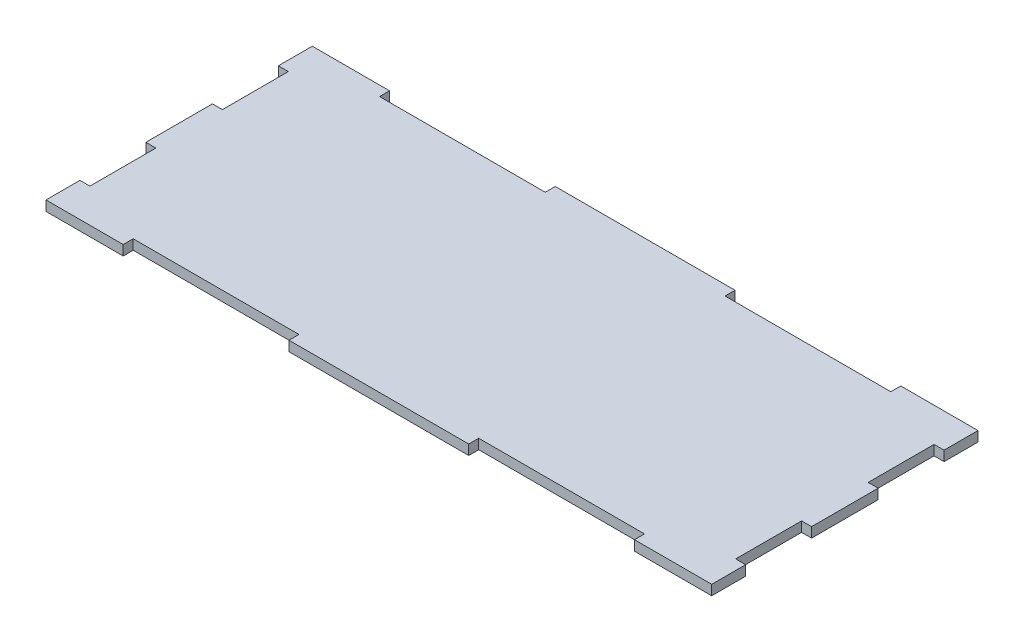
ISO-10303-21;
HEADER;
FILE_DESCRIPTION(('STEP AP214'),'2;1');
FILE_NAME('part.step','',(''),(''),'','','');
FILE_SCHEMA(('AUTOMOTIVE_DESIGN { 1 0 10303 214 1 1 1 1 }'));
ENDSEC;
DATA;
#1=APPLICATION_CONTEXT('core data for automotive mechanical design processes');
#2=APPLICATION_PROTOCOL_DEFINITION('international standard','automotive_design',2000,#1);
#3=PRODUCT_CONTEXT('',#1,'mechanical');
#4=PRODUCT('Part','Part','',(#3));
#5=PRODUCT_RELATED_PRODUCT_CATEGORY('part','',(#4));
#6=PRODUCT_DEFINITION_FORMATION('','',#4);
#7=PRODUCT_DEFINITION_CONTEXT('part definition',#1,'design');
#8=PRODUCT_DEFINITION('design','',#6,#7);
#9=PRODUCT_DEFINITION_SHAPE('','',#8);
#10=(LENGTH_UNIT() NAMED_UNIT(*) SI_UNIT(.MILLI.,.METRE.));
#11=(NAMED_UNIT(*) PLANE_ANGLE_UNIT() SI_UNIT($,.RADIAN.));
#12=(NAMED_UNIT(*) SI_UNIT($,.STERADIAN.) SOLID_ANGLE_UNIT());
#13=UNCERTAINTY_MEASURE_WITH_UNIT(LENGTH_MEASURE(1.E-05),#10,'distance_accuracy_value','');
#14=(GEOMETRIC_REPRESENTATION_CONTEXT(3) GLOBAL_UNCERTAINTY_ASSIGNED_CONTEXT((#13)) GLOBAL_UNIT_ASSIGNED_CONTEXT((#10,
#11,#12)) REPRESENTATION_CONTEXT('',''));
#15=CARTESIAN_POINT('',(0.,0.,0.));
#16=DIRECTION('',(0.,0.,1.));
#17=DIRECTION('',(1.,0.,0.));
#18=AXIS2_PLACEMENT_3D('',#15,#16,#17);
#19=CARTESIAN_POINT('',(0.,0.,80.));
#20=DIRECTION('',(0.,0.,-1.));
#21=DIRECTION('',(-1.,0.,0.));
#22=AXIS2_PLACEMENT_3D('',#19,#20,#21);
#23=PLANE('',#22);
#24=DIRECTION('',(1.,0.,0.));
#25=VECTOR('',#24,1.);
#26=CARTESIAN_POINT('',(0.,-3.,80.));
#27=LINE('',#26,#25);
#28=CARTESIAN_POINT('',(73.,-3.,80.));
#29=VERTEX_POINT('',#28);
#30=CARTESIAN_POINT('',(127.,-3.,80.));
#31=VERTEX_POINT('',#30);
#32=EDGE_CURVE('E289',#29,#31,#27,.T.);
#33=ORIENTED_EDGE('',*,*,#32,.T.);
#34=DIRECTION('',(0.,1.,0.));
#35=VECTOR('',#34,1.);
#36=CARTESIAN_POINT('',(127.,-3.,80.));
#37=LINE('',#36,#35);
#38=CARTESIAN_POINT('',(127.,0.,80.));
#39=VERTEX_POINT('',#38);
#40=EDGE_CURVE('E455',#31,#39,#37,.T.);
#41=ORIENTED_EDGE('',*,*,#40,.T.);
#42=DIRECTION('',(1.,0.,0.));
#43=VECTOR('',#42,1.);
#44=CARTESIAN_POINT('',(0.,0.,80.));
#45=LINE('',#44,#43);
#46=CARTESIAN_POINT('',(73.,0.,80.));
#47=VERTEX_POINT('',#46);
#48=EDGE_CURVE('E307',#47,#39,#45,.T.);
#49=ORIENTED_EDGE('',*,*,#48,.F.);
#50=DIRECTION('',(0.,1.,0.));
#51=VECTOR('',#50,1.);
#52=CARTESIAN_POINT('',(73.,-3.,80.));
#53=LINE('',#52,#51);
#54=EDGE_CURVE('E459',#29,#47,#53,.T.);
#55=ORIENTED_EDGE('',*,*,#54,.F.);
#56=EDGE_LOOP('',(#33,#41,#49,#55));
#57=FACE_BOUND('',#56,.T.);
#58=ADVANCED_FACE('F35',(#57),#23,.F.);
#59=CARTESIAN_POINT('',(0.,0.,0.));
#60=DIRECTION('',(0.,0.,-1.));
#61=DIRECTION('',(-1.,0.,0.));
#62=AXIS2_PLACEMENT_3D('',#59,#60,#61);
#63=PLANE('',#62);
#64=DIRECTION('',(0.,1.,0.));
#65=VECTOR('',#64,1.);
#66=CARTESIAN_POINT('',(73.,-3.,0.));
#67=LINE('',#66,#65);
#68=CARTESIAN_POINT('',(73.,-3.,0.));
#69=VERTEX_POINT('',#68);
#70=CARTESIAN_POINT('',(73.,0.,0.));
#71=VERTEX_POINT('',#70);
#72=EDGE_CURVE('E410',#69,#71,#67,.T.);
#73=ORIENTED_EDGE('',*,*,#72,.T.);
#74=DIRECTION('',(1.,0.,0.));
#75=VECTOR('',#74,1.);
#76=CARTESIAN_POINT('',(0.,0.,0.));
#77=LINE('',#76,#75);
#78=CARTESIAN_POINT('',(127.,0.,0.));
#79=VERTEX_POINT('',#78);
#80=EDGE_CURVE('E326',#71,#79,#77,.T.);
#81=ORIENTED_EDGE('',*,*,#80,.T.);
#82=DIRECTION('',(0.,1.,0.));
#83=VECTOR('',#82,1.);
#84=CARTESIAN_POINT('',(127.,-3.,0.));
#85=LINE('',#84,#83);
#86=CARTESIAN_POINT('',(127.,-3.,0.));
#87=VERTEX_POINT('',#86);
#88=EDGE_CURVE('E398',#87,#79,#85,.T.);
#89=ORIENTED_EDGE('',*,*,#88,.F.);
#90=DIRECTION('',(1.,0.,0.));
#91=VECTOR('',#90,1.);
#92=CARTESIAN_POINT('',(0.,-3.,0.));
#93=LINE('',#92,#91);
#94=EDGE_CURVE('E320',#69,#87,#93,.T.);
#95=ORIENTED_EDGE('',*,*,#94,.F.);
#96=EDGE_LOOP('',(#73,#81,#89,#95));
#97=FACE_BOUND('',#96,.T.);
#98=ADVANCED_FACE('F554',(#97),#63,.T.);
#99=DIRECTION('',(0.,1.,0.));
#100=VECTOR('',#99,1.);
#101=CARTESIAN_POINT('',(23.2,-3.,0.));
#102=LINE('',#101,#100);
#103=CARTESIAN_POINT('',(23.2,-3.,0.));
#104=VERTEX_POINT('',#103);
#105=CARTESIAN_POINT('',(23.2,0.,0.));
#106=VERTEX_POINT('',#105);
#107=EDGE_CURVE('E382',#104,#106,#102,.T.);
#108=ORIENTED_EDGE('',*,*,#107,.F.);
#109=CARTESIAN_POINT('',(0.,-3.,0.));
#110=VERTEX_POINT('',#109);
#111=EDGE_CURVE('E316',#110,#104,#93,.T.);
#112=ORIENTED_EDGE('',*,*,#111,.F.);
#113=DIRECTION('',(0.,1.,0.));
#114=VECTOR('',#113,1.);
#115=CARTESIAN_POINT('',(0.,-3.,0.));
#116=LINE('',#115,#114);
#117=CARTESIAN_POINT('',(0.,0.,0.));
#118=VERTEX_POINT('',#117);
#119=EDGE_CURVE('E290',#110,#118,#116,.T.);
#120=ORIENTED_EDGE('',*,*,#119,.T.);
#121=EDGE_CURVE('E295',#118,#106,#77,.T.);
#122=ORIENTED_EDGE('',*,*,#121,.T.);
#123=EDGE_LOOP('',(#108,#112,#120,#122));
#124=FACE_BOUND('',#123,.T.);
#125=ADVANCED_FACE('F381',(#124),#63,.T.);
#126=CARTESIAN_POINT('',(176.8,0.,80.));
#127=VERTEX_POINT('',#126);
#128=CARTESIAN_POINT('',(200.,0.,80.));
#129=VERTEX_POINT('',#128);
#130=EDGE_CURVE('E282',#127,#129,#45,.T.);
#131=ORIENTED_EDGE('',*,*,#130,.F.);
#132=DIRECTION('',(0.,1.,0.));
#133=VECTOR('',#132,1.);
#134=CARTESIAN_POINT('',(176.8,-3.,80.));
#135=LINE('',#134,#133);
#136=CARTESIAN_POINT('',(176.8,-3.,80.));
#137=VERTEX_POINT('',#136);
#138=EDGE_CURVE('E50',#137,#127,#135,.T.);
#139=ORIENTED_EDGE('',*,*,#138,.F.);
#140=CARTESIAN_POINT('',(200.,-3.,80.));
#141=VERTEX_POINT('',#140);
#142=EDGE_CURVE('E280',#137,#141,#27,.T.);
#143=ORIENTED_EDGE('',*,*,#142,.T.);
#144=DIRECTION('',(0.,-1.,0.));
#145=VECTOR('',#144,1.);
#146=CARTESIAN_POINT('',(200.,0.,80.));
#147=LINE('',#146,#145);
#148=EDGE_CURVE('E300',#129,#141,#147,.T.);
#149=ORIENTED_EDGE('',*,*,#148,.F.);
#150=EDGE_LOOP('',(#131,#139,#143,#149));
#151=FACE_BOUND('',#150,.T.);
#152=ADVANCED_FACE('F278',(#151),#23,.F.);
#153=CARTESIAN_POINT('',(200.,0.,80.));
#154=DIRECTION('',(1.,0.,0.));
#155=DIRECTION('',(0.,0.,-1.));
#156=AXIS2_PLACEMENT_3D('',#153,#154,#155);
#157=PLANE('',#156);
#158=DIRECTION('',(0.,1.,0.));
#159=VECTOR('',#158,1.);
#160=CARTESIAN_POINT('',(200.,-10.,69.8));
#161=LINE('',#160,#159);
#162=CARTESIAN_POINT('',(200.,-3.,69.8));
#163=VERTEX_POINT('',#162);
#164=CARTESIAN_POINT('',(200.,0.,69.8));
#165=VERTEX_POINT('',#164);
#166=EDGE_CURVE('E471',#163,#165,#161,.T.);
#167=ORIENTED_EDGE('',*,*,#166,.T.);
#168=DIRECTION('',(0.,0.,-1.));
#169=VECTOR('',#168,1.);
#170=CARTESIAN_POINT('',(200.,0.,80.));
#171=LINE('',#170,#169);
#172=EDGE_CURVE('E338',#129,#165,#171,.T.);
#173=ORIENTED_EDGE('',*,*,#172,.F.);
#174=ORIENTED_EDGE('',*,*,#148,.T.);
#175=DIRECTION('',(0.,0.,-1.));
#176=VECTOR('',#175,1.);
#177=CARTESIAN_POINT('',(200.,-3.,80.));
#178=LINE('',#177,#176);
#179=EDGE_CURVE('E287',#141,#163,#178,.T.);
#180=ORIENTED_EDGE('',*,*,#179,.T.);
#181=EDGE_LOOP('',(#167,#173,#174,#180));
#182=FACE_BOUND('',#181,.T.);
#183=ADVANCED_FACE('F615',(#182),#157,.T.);
#184=DIRECTION('',(0.,1.,0.));
#185=VECTOR('',#184,1.);
#186=CARTESIAN_POINT('',(200.,-10.,10.2));
#187=LINE('',#186,#185);
#188=CARTESIAN_POINT('',(200.,-3.,10.2));
#189=VERTEX_POINT('',#188);
#190=CARTESIAN_POINT('',(200.,0.,10.2));
#191=VERTEX_POINT('',#190);
#192=EDGE_CURVE('E482',#189,#191,#187,.T.);
#193=ORIENTED_EDGE('',*,*,#192,.F.);
#194=CARTESIAN_POINT('',(200.,-3.,0.));
#195=VERTEX_POINT('',#194);
#196=EDGE_CURVE('E341',#189,#195,#178,.T.);
#197=ORIENTED_EDGE('',*,*,#196,.T.);
#198=DIRECTION('',(0.,-1.,0.));
#199=VECTOR('',#198,1.);
#200=CARTESIAN_POINT('',(200.,0.,0.));
#201=LINE('',#200,#199);
#202=CARTESIAN_POINT('',(200.,0.,0.));
#203=VERTEX_POINT('',#202);
#204=EDGE_CURVE('E319',#203,#195,#201,.T.);
#205=ORIENTED_EDGE('',*,*,#204,.F.);
#206=EDGE_CURVE('E336',#191,#203,#171,.T.);
#207=ORIENTED_EDGE('',*,*,#206,.F.);
#208=EDGE_LOOP('',(#193,#197,#205,#207));
#209=FACE_BOUND('',#208,.T.);
#210=ADVANCED_FACE('F573',(#209),#157,.T.);
#211=CARTESIAN_POINT('',(0.,-3.,80.));
#212=DIRECTION('',(-1.,0.,0.));
#213=DIRECTION('',(0.,0.,1.));
#214=AXIS2_PLACEMENT_3D('',#211,#212,#213);
#215=PLANE('',#214);
#216=DIRECTION('',(0.,1.,0.));
#217=VECTOR('',#216,1.);
#218=CARTESIAN_POINT('',(0.,-3.,69.8));
#219=LINE('',#218,#217);
#220=CARTESIAN_POINT('',(0.,-3.,69.8));
#221=VERTEX_POINT('',#220);
#222=CARTESIAN_POINT('',(0.,0.,69.8));
#223=VERTEX_POINT('',#222);
#224=EDGE_CURVE('E11',#221,#223,#219,.T.);
#225=ORIENTED_EDGE('',*,*,#224,.F.);
#226=DIRECTION('',(0.,0.,-1.));
#227=VECTOR('',#226,1.);
#228=CARTESIAN_POINT('',(0.,-3.,80.));
#229=LINE('',#228,#227);
#230=CARTESIAN_POINT('',(0.,-3.,80.));
#231=VERTEX_POINT('',#230);
#232=EDGE_CURVE('E328',#231,#221,#229,.T.);
#233=ORIENTED_EDGE('',*,*,#232,.F.);
#234=DIRECTION('',(0.,1.,0.));
#235=VECTOR('',#234,1.);
#236=CARTESIAN_POINT('',(0.,-3.,80.));
#237=LINE('',#236,#235);
#238=CARTESIAN_POINT('',(0.,0.,80.));
#239=VERTEX_POINT('',#238);
#240=EDGE_CURVE('E312',#231,#239,#237,.T.);
#241=ORIENTED_EDGE('',*,*,#240,.T.);
#242=DIRECTION('',(0.,0.,-1.));
#243=VECTOR('',#242,1.);
#244=CARTESIAN_POINT('',(0.,0.,80.));
#245=LINE('',#244,#243);
#246=EDGE_CURVE('E333',#239,#223,#245,.T.);
#247=ORIENTED_EDGE('',*,*,#246,.T.);
#248=EDGE_LOOP('',(#225,#233,#241,#247));
#249=FACE_BOUND('',#248,.T.);
#250=ADVANCED_FACE('F623',(#249),#215,.T.);
#251=DIRECTION('',(0.,-1.,0.));
#252=VECTOR('',#251,1.);
#253=CARTESIAN_POINT('',(0.,-3.,10.2));
#254=LINE('',#253,#252);
#255=CARTESIAN_POINT('',(0.,0.,10.2));
#256=VERTEX_POINT('',#255);
#257=CARTESIAN_POINT('',(0.,-3.,10.2));
#258=VERTEX_POINT('',#257);
#259=EDGE_CURVE('E348',#256,#258,#254,.T.);
#260=ORIENTED_EDGE('',*,*,#259,.F.);
#261=EDGE_CURVE('E331',#256,#118,#245,.T.);
#262=ORIENTED_EDGE('',*,*,#261,.T.);
#263=ORIENTED_EDGE('',*,*,#119,.F.);
#264=EDGE_CURVE('E315',#258,#110,#229,.T.);
#265=ORIENTED_EDGE('',*,*,#264,.F.);
#266=EDGE_LOOP('',(#260,#262,#263,#265));
#267=FACE_BOUND('',#266,.T.);
#268=ADVANCED_FACE('F383',(#267),#215,.T.);
#269=CARTESIAN_POINT('',(0.,-3.,80.));
#270=DIRECTION('',(0.,1.,0.));
#271=DIRECTION('',(0.,0.,1.));
#272=AXIS2_PLACEMENT_3D('',#269,#270,#271);
#273=PLANE('',#272);
#274=DIRECTION('',(-1.,0.,0.));
#275=VECTOR('',#274,1.);
#276=CARTESIAN_POINT('',(127.,-3.,77.));
#277=LINE('',#276,#275);
#278=CARTESIAN_POINT('',(176.8,-3.,77.));
#279=VERTEX_POINT('',#278);
#280=CARTESIAN_POINT('',(127.,-3.,77.));
#281=VERTEX_POINT('',#280);
#282=EDGE_CURVE('E273',#279,#281,#277,.T.);
#283=ORIENTED_EDGE('',*,*,#282,.T.);
#284=DIRECTION('',(0.,0.,1.));
#285=VECTOR('',#284,1.);
#286=CARTESIAN_POINT('',(127.,-3.,80.));
#287=LINE('',#286,#285);
#288=EDGE_CURVE('E283',#281,#31,#287,.T.);
#289=ORIENTED_EDGE('',*,*,#288,.T.);
#290=ORIENTED_EDGE('',*,*,#32,.F.);
#291=DIRECTION('',(0.,0.,-1.));
#292=VECTOR('',#291,1.);
#293=CARTESIAN_POINT('',(73.,-3.,80.));
#294=LINE('',#293,#292);
#295=CARTESIAN_POINT('',(73.,-3.,77.));
#296=VERTEX_POINT('',#295);
#297=EDGE_CURVE('E440',#29,#296,#294,.T.);
#298=ORIENTED_EDGE('',*,*,#297,.T.);
#299=DIRECTION('',(-1.,0.,0.));
#300=VECTOR('',#299,1.);
#301=CARTESIAN_POINT('',(73.,-3.,77.));
#302=LINE('',#301,#300);
#303=CARTESIAN_POINT('',(23.2,-3.,77.));
#304=VERTEX_POINT('',#303);
#305=EDGE_CURVE('E443',#296,#304,#302,.T.);
#306=ORIENTED_EDGE('',*,*,#305,.T.);
#307=DIRECTION('',(0.,0.,1.));
#308=VECTOR('',#307,1.);
#309=CARTESIAN_POINT('',(23.2,-3.,80.));
#310=LINE('',#309,#308);
#311=CARTESIAN_POINT('',(23.2,-3.,80.));
#312=VERTEX_POINT('',#311);
#313=EDGE_CURVE('E447',#304,#312,#310,.T.);
#314=ORIENTED_EDGE('',*,*,#313,.T.);
#315=EDGE_CURVE('E292',#231,#312,#27,.T.);
#316=ORIENTED_EDGE('',*,*,#315,.F.);
#317=ORIENTED_EDGE('',*,*,#232,.T.);
#318=DIRECTION('',(1.,0.,0.));
#319=VECTOR('',#318,1.);
#320=CARTESIAN_POINT('',(0.,-3.,69.8));
#321=LINE('',#320,#319);
#322=CARTESIAN_POINT('',(3.,-3.,69.8));
#323=VERTEX_POINT('',#322);
#324=EDGE_CURVE('E365',#221,#323,#321,.T.);
#325=ORIENTED_EDGE('',*,*,#324,.T.);
#326=DIRECTION('',(0.,0.,-1.));
#327=VECTOR('',#326,1.);
#328=CARTESIAN_POINT('',(3.,-3.,80.));
#329=LINE('',#328,#327);
#330=CARTESIAN_POINT('',(3.,-3.,50.));
#331=VERTEX_POINT('',#330);
#332=EDGE_CURVE('E364',#323,#331,#329,.T.);
#333=ORIENTED_EDGE('',*,*,#332,.T.);
#334=DIRECTION('',(-1.,0.,0.));
#335=VECTOR('',#334,1.);
#336=CARTESIAN_POINT('',(0.,-3.,50.));
#337=LINE('',#336,#335);
#338=CARTESIAN_POINT('',(0.,-3.,50.));
#339=VERTEX_POINT('',#338);
#340=EDGE_CURVE('E353',#331,#339,#337,.T.);
#341=ORIENTED_EDGE('',*,*,#340,.T.);
#342=CARTESIAN_POINT('',(0.,-3.,30.));
#343=VERTEX_POINT('',#342);
#344=EDGE_CURVE('E332',#339,#343,#229,.T.);
#345=ORIENTED_EDGE('',*,*,#344,.T.);
#346=DIRECTION('',(1.,0.,0.));
#347=VECTOR('',#346,1.);
#348=CARTESIAN_POINT('',(0.,-3.,30.));
#349=LINE('',#348,#347);
#350=CARTESIAN_POINT('',(3.,-3.,30.));
#351=VERTEX_POINT('',#350);
#352=EDGE_CURVE('E540',#343,#351,#349,.T.);
#353=ORIENTED_EDGE('',*,*,#352,.T.);
#354=DIRECTION('',(0.,0.,-1.));
#355=VECTOR('',#354,1.);
#356=CARTESIAN_POINT('',(3.00000000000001,-3.,80.));
#357=LINE('',#356,#355);
#358=CARTESIAN_POINT('',(3.,-3.,10.2));
#359=VERTEX_POINT('',#358);
#360=EDGE_CURVE('E543',#351,#359,#357,.T.);
#361=ORIENTED_EDGE('',*,*,#360,.T.);
#362=DIRECTION('',(-1.,0.,0.));
#363=VECTOR('',#362,1.);
#364=CARTESIAN_POINT('',(0.,-3.,10.2));
#365=LINE('',#364,#363);
#366=EDGE_CURVE('E375',#359,#258,#365,.T.);
#367=ORIENTED_EDGE('',*,*,#366,.T.);
#368=ORIENTED_EDGE('',*,*,#264,.T.);
#369=ORIENTED_EDGE('',*,*,#111,.T.);
#370=DIRECTION('',(0.,0.,1.));
#371=VECTOR('',#370,1.);
#372=CARTESIAN_POINT('',(23.2,-3.,0.));
#373=LINE('',#372,#371);
#374=CARTESIAN_POINT('',(23.2,-3.,3.00000000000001));
#375=VERTEX_POINT('',#374);
#376=EDGE_CURVE('E409',#104,#375,#373,.T.);
#377=ORIENTED_EDGE('',*,*,#376,.T.);
#378=DIRECTION('',(1.,0.,0.));
#379=VECTOR('',#378,1.);
#380=CARTESIAN_POINT('',(73.,-3.,3.));
#381=LINE('',#380,#379);
#382=CARTESIAN_POINT('',(73.,-3.,3.));
#383=VERTEX_POINT('',#382);
#384=EDGE_CURVE('E936',#375,#383,#381,.T.);
#385=ORIENTED_EDGE('',*,*,#384,.T.);
#386=DIRECTION('',(0.,0.,-1.));
#387=VECTOR('',#386,1.);
#388=CARTESIAN_POINT('',(73.,-3.,0.));
#389=LINE('',#388,#387);
#390=EDGE_CURVE('E405',#383,#69,#389,.T.);
#391=ORIENTED_EDGE('',*,*,#390,.T.);
#392=ORIENTED_EDGE('',*,*,#94,.T.);
#393=DIRECTION('',(0.,0.,1.));
#394=VECTOR('',#393,1.);
#395=CARTESIAN_POINT('',(127.,-3.,0.));
#396=LINE('',#395,#394);
#397=CARTESIAN_POINT('',(127.,-3.,3.));
#398=VERTEX_POINT('',#397);
#399=EDGE_CURVE('E419',#87,#398,#396,.T.);
#400=ORIENTED_EDGE('',*,*,#399,.T.);
#401=DIRECTION('',(1.,0.,0.));
#402=VECTOR('',#401,1.);
#403=CARTESIAN_POINT('',(127.,-3.,3.));
#404=LINE('',#403,#402);
#405=CARTESIAN_POINT('',(176.8,-3.,2.99999999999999));
#406=VERTEX_POINT('',#405);
#407=EDGE_CURVE('E422',#398,#406,#404,.T.);
#408=ORIENTED_EDGE('',*,*,#407,.T.);
#409=DIRECTION('',(0.,0.,-1.));
#410=VECTOR('',#409,1.);
#411=CARTESIAN_POINT('',(176.8,-3.,0.));
#412=LINE('',#411,#410);
#413=CARTESIAN_POINT('',(176.8,-3.,0.));
#414=VERTEX_POINT('',#413);
#415=EDGE_CURVE('E425',#406,#414,#412,.T.);
#416=ORIENTED_EDGE('',*,*,#415,.T.);
#417=EDGE_CURVE('E321',#414,#195,#93,.T.);
#418=ORIENTED_EDGE('',*,*,#417,.T.);
#419=ORIENTED_EDGE('',*,*,#196,.F.);
#420=DIRECTION('',(-1.,0.,0.));
#421=VECTOR('',#420,1.);
#422=CARTESIAN_POINT('',(0.,-3.,10.2));
#423=LINE('',#422,#421);
#424=CARTESIAN_POINT('',(197.,-3.,10.2));
#425=VERTEX_POINT('',#424);
#426=EDGE_CURVE('E517',#189,#425,#423,.T.);
#427=ORIENTED_EDGE('',*,*,#426,.T.);
#428=DIRECTION('',(0.,0.,1.));
#429=VECTOR('',#428,1.);
#430=CARTESIAN_POINT('',(197.,-3.,80.0000000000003));
#431=LINE('',#430,#429);
#432=CARTESIAN_POINT('',(197.,-3.,30.));
#433=VERTEX_POINT('',#432);
#434=EDGE_CURVE('E511',#425,#433,#431,.T.);
#435=ORIENTED_EDGE('',*,*,#434,.T.);
#436=DIRECTION('',(1.,0.,0.));
#437=VECTOR('',#436,1.);
#438=CARTESIAN_POINT('',(0.,-3.,30.));
#439=LINE('',#438,#437);
#440=CARTESIAN_POINT('',(200.,-3.,30.));
#441=VERTEX_POINT('',#440);
#442=EDGE_CURVE('E514',#433,#441,#439,.T.);
#443=ORIENTED_EDGE('',*,*,#442,.T.);
#444=CARTESIAN_POINT('',(200.,-3.,50.));
#445=VERTEX_POINT('',#444);
#446=EDGE_CURVE('E345',#445,#441,#178,.T.);
#447=ORIENTED_EDGE('',*,*,#446,.F.);
#448=DIRECTION('',(-1.,0.,0.));
#449=VECTOR('',#448,1.);
#450=CARTESIAN_POINT('',(0.,-3.,50.));
#451=LINE('',#450,#449);
#452=CARTESIAN_POINT('',(197.,-3.,50.));
#453=VERTEX_POINT('',#452);
#454=EDGE_CURVE('E520',#445,#453,#451,.T.);
#455=ORIENTED_EDGE('',*,*,#454,.T.);
#456=DIRECTION('',(0.,0.,1.));
#457=VECTOR('',#456,1.);
#458=CARTESIAN_POINT('',(197.,-3.,79.9999999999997));
#459=LINE('',#458,#457);
#460=CARTESIAN_POINT('',(197.,-3.,69.8));
#461=VERTEX_POINT('',#460);
#462=EDGE_CURVE('E523',#453,#461,#459,.T.);
#463=ORIENTED_EDGE('',*,*,#462,.T.);
#464=DIRECTION('',(1.,0.,0.));
#465=VECTOR('',#464,1.);
#466=CARTESIAN_POINT('',(0.,-3.,69.8));
#467=LINE('',#466,#465);
#468=EDGE_CURVE('E526',#461,#163,#467,.T.);
#469=ORIENTED_EDGE('',*,*,#468,.T.);
#470=ORIENTED_EDGE('',*,*,#179,.F.);
#471=ORIENTED_EDGE('',*,*,#142,.F.);
#472=DIRECTION('',(0.,0.,-1.));
#473=VECTOR('',#472,1.);
#474=CARTESIAN_POINT('',(176.8,-3.,80.));
#475=LINE('',#474,#473);
#476=EDGE_CURVE('E266',#137,#279,#475,.T.);
#477=ORIENTED_EDGE('',*,*,#476,.T.);
#478=EDGE_LOOP('',(#283,#289,#290,#298,#306,#314,#316,#317,#325,#333,#341,#345,#353,#361,#367,
#368,#369,#377,#385,#391,#392,#400,#408,#416,#418,#419,#427,#435,#443,#447,#455,#463,#469,#470,
#471,#477));
#479=FACE_BOUND('',#478,.T.);
#480=ADVANCED_FACE('F37',(#479),#273,.F.);
#481=DIRECTION('',(0.,1.,0.));
#482=VECTOR('',#481,1.);
#483=CARTESIAN_POINT('',(200.,-10.,50.));
#484=LINE('',#483,#482);
#485=CARTESIAN_POINT('',(200.,0.,50.));
#486=VERTEX_POINT('',#485);
#487=EDGE_CURVE('E487',#445,#486,#484,.T.);
#488=ORIENTED_EDGE('',*,*,#487,.F.);
#489=ORIENTED_EDGE('',*,*,#446,.T.);
#490=DIRECTION('',(0.,1.,0.));
#491=VECTOR('',#490,1.);
#492=CARTESIAN_POINT('',(200.,-10.,30.));
#493=LINE('',#492,#491);
#494=CARTESIAN_POINT('',(200.,0.,30.));
#495=VERTEX_POINT('',#494);
#496=EDGE_CURVE('E503',#441,#495,#493,.T.);
#497=ORIENTED_EDGE('',*,*,#496,.T.);
#498=EDGE_CURVE('E342',#486,#495,#171,.T.);
#499=ORIENTED_EDGE('',*,*,#498,.F.);
#500=EDGE_LOOP('',(#488,#489,#497,#499));
#501=FACE_BOUND('',#500,.T.);
#502=ADVANCED_FACE('F578',(#501),#157,.T.);
#503=CARTESIAN_POINT('',(0.,0.,80.));
#504=DIRECTION('',(0.,1.,0.));
#505=DIRECTION('',(0.,0.,1.));
#506=AXIS2_PLACEMENT_3D('',#503,#504,#505);
#507=PLANE('',#506);
#508=DIRECTION('',(0.,0.,1.));
#509=VECTOR('',#508,1.);
#510=CARTESIAN_POINT('',(127.,0.,80.));
#511=LINE('',#510,#509);
#512=CARTESIAN_POINT('',(127.,0.,77.));
#513=VERTEX_POINT('',#512);
#514=EDGE_CURVE('E274',#513,#39,#511,.T.);
#515=ORIENTED_EDGE('',*,*,#514,.F.);
#516=DIRECTION('',(-1.,0.,0.));
#517=VECTOR('',#516,1.);
#518=CARTESIAN_POINT('',(127.,0.,77.));
#519=LINE('',#518,#517);
#520=CARTESIAN_POINT('',(176.8,0.,77.));
#521=VERTEX_POINT('',#520);
#522=EDGE_CURVE('E922',#521,#513,#519,.T.);
#523=ORIENTED_EDGE('',*,*,#522,.F.);
#524=DIRECTION('',(0.,0.,-1.));
#525=VECTOR('',#524,1.);
#526=CARTESIAN_POINT('',(176.8,0.,80.));
#527=LINE('',#526,#525);
#528=EDGE_CURVE('E413',#127,#521,#527,.T.);
#529=ORIENTED_EDGE('',*,*,#528,.F.);
#530=ORIENTED_EDGE('',*,*,#130,.T.);
#531=ORIENTED_EDGE('',*,*,#172,.T.);
#532=DIRECTION('',(1.,0.,0.));
#533=VECTOR('',#532,1.);
#534=CARTESIAN_POINT('',(200.,0.,69.8));
#535=LINE('',#534,#533);
#536=CARTESIAN_POINT('',(197.,0.,69.8));
#537=VERTEX_POINT('',#536);
#538=EDGE_CURVE('E485',#537,#165,#535,.T.);
#539=ORIENTED_EDGE('',*,*,#538,.F.);
#540=DIRECTION('',(0.,0.,1.));
#541=VECTOR('',#540,1.);
#542=CARTESIAN_POINT('',(197.,0.,69.8));
#543=LINE('',#542,#541);
#544=CARTESIAN_POINT('',(197.,0.,50.));
#545=VERTEX_POINT('',#544);
#546=EDGE_CURVE('E481',#545,#537,#543,.T.);
#547=ORIENTED_EDGE('',*,*,#546,.F.);
#548=DIRECTION('',(-1.,0.,0.));
#549=VECTOR('',#548,1.);
#550=CARTESIAN_POINT('',(200.,0.,50.));
#551=LINE('',#550,#549);
#552=EDGE_CURVE('E478',#486,#545,#551,.T.);
#553=ORIENTED_EDGE('',*,*,#552,.F.);
#554=ORIENTED_EDGE('',*,*,#498,.T.);
#555=DIRECTION('',(1.,0.,0.));
#556=VECTOR('',#555,1.);
#557=CARTESIAN_POINT('',(200.,0.,30.));
#558=LINE('',#557,#556);
#559=CARTESIAN_POINT('',(197.,0.,30.));
#560=VERTEX_POINT('',#559);
#561=EDGE_CURVE('E499',#560,#495,#558,.T.);
#562=ORIENTED_EDGE('',*,*,#561,.F.);
#563=DIRECTION('',(0.,0.,1.));
#564=VECTOR('',#563,1.);
#565=CARTESIAN_POINT('',(197.,0.,10.2));
#566=LINE('',#565,#564);
#567=CARTESIAN_POINT('',(197.,0.,10.2));
#568=VERTEX_POINT('',#567);
#569=EDGE_CURVE('E496',#568,#560,#566,.T.);
#570=ORIENTED_EDGE('',*,*,#569,.F.);
#571=DIRECTION('',(-1.,0.,0.));
#572=VECTOR('',#571,1.);
#573=CARTESIAN_POINT('',(200.,0.,10.2));
#574=LINE('',#573,#572);
#575=EDGE_CURVE('E461',#191,#568,#574,.T.);
#576=ORIENTED_EDGE('',*,*,#575,.F.);
#577=ORIENTED_EDGE('',*,*,#206,.T.);
#578=CARTESIAN_POINT('',(176.8,0.,0.));
#579=VERTEX_POINT('',#578);
#580=EDGE_CURVE('E324',#579,#203,#77,.T.);
#581=ORIENTED_EDGE('',*,*,#580,.F.);
#582=DIRECTION('',(0.,0.,-1.));
#583=VECTOR('',#582,1.);
#584=CARTESIAN_POINT('',(176.8,0.,0.));
#585=LINE('',#584,#583);
#586=CARTESIAN_POINT('',(176.8,0.,2.99999999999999));
#587=VERTEX_POINT('',#586);
#588=EDGE_CURVE('E58',#587,#579,#585,.T.);
#589=ORIENTED_EDGE('',*,*,#588,.F.);
#590=DIRECTION('',(1.,0.,0.));
#591=VECTOR('',#590,1.);
#592=CARTESIAN_POINT('',(127.,0.,3.));
#593=LINE('',#592,#591);
#594=CARTESIAN_POINT('',(127.,0.,3.));
#595=VERTEX_POINT('',#594);
#596=EDGE_CURVE('E432',#595,#587,#593,.T.);
#597=ORIENTED_EDGE('',*,*,#596,.F.);
#598=DIRECTION('',(0.,0.,1.));
#599=VECTOR('',#598,1.);
#600=CARTESIAN_POINT('',(127.,0.,0.));
#601=LINE('',#600,#599);
#602=EDGE_CURVE('E429',#79,#595,#601,.T.);
#603=ORIENTED_EDGE('',*,*,#602,.F.);
#604=ORIENTED_EDGE('',*,*,#80,.F.);
#605=DIRECTION('',(0.,0.,-1.));
#606=VECTOR('',#605,1.);
#607=CARTESIAN_POINT('',(73.,0.,0.));
#608=LINE('',#607,#606);
#609=CARTESIAN_POINT('',(73.,0.,3.));
#610=VERTEX_POINT('',#609);
#611=EDGE_CURVE('E400',#610,#71,#608,.T.);
#612=ORIENTED_EDGE('',*,*,#611,.F.);
#613=DIRECTION('',(1.,0.,0.));
#614=VECTOR('',#613,1.);
#615=CARTESIAN_POINT('',(73.,0.,3.));
#616=LINE('',#615,#614);
#617=CARTESIAN_POINT('',(23.2,0.,3.00000000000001));
#618=VERTEX_POINT('',#617);
#619=EDGE_CURVE('E396',#618,#610,#616,.T.);
#620=ORIENTED_EDGE('',*,*,#619,.F.);
#621=DIRECTION('',(0.,0.,1.));
#622=VECTOR('',#621,1.);
#623=CARTESIAN_POINT('',(23.2,0.,0.));
#624=LINE('',#623,#622);
#625=EDGE_CURVE('E393',#106,#618,#624,.T.);
#626=ORIENTED_EDGE('',*,*,#625,.F.);
#627=ORIENTED_EDGE('',*,*,#121,.F.);
#628=ORIENTED_EDGE('',*,*,#261,.F.);
#629=DIRECTION('',(-1.,0.,0.));
#630=VECTOR('',#629,1.);
#631=CARTESIAN_POINT('',(0.,0.,10.2));
#632=LINE('',#631,#630);
#633=CARTESIAN_POINT('',(3.,0.,10.2));
#634=VERTEX_POINT('',#633);
#635=EDGE_CURVE('E535',#634,#256,#632,.T.);
#636=ORIENTED_EDGE('',*,*,#635,.F.);
#637=DIRECTION('',(0.,0.,-1.));
#638=VECTOR('',#637,1.);
#639=CARTESIAN_POINT('',(3.,0.,10.2));
#640=LINE('',#639,#638);
#641=CARTESIAN_POINT('',(3.,0.,30.));
#642=VERTEX_POINT('',#641);
#643=EDGE_CURVE('E532',#642,#634,#640,.T.);
#644=ORIENTED_EDGE('',*,*,#643,.F.);
#645=DIRECTION('',(1.,0.,0.));
#646=VECTOR('',#645,1.);
#647=CARTESIAN_POINT('',(0.,0.,30.));
#648=LINE('',#647,#646);
#649=CARTESIAN_POINT('',(0.,0.,30.));
#650=VERTEX_POINT('',#649);
#651=EDGE_CURVE('E529',#650,#642,#648,.T.);
#652=ORIENTED_EDGE('',*,*,#651,.F.);
#653=CARTESIAN_POINT('',(0.,0.,50.));
#654=VERTEX_POINT('',#653);
#655=EDGE_CURVE('E337',#654,#650,#245,.T.);
#656=ORIENTED_EDGE('',*,*,#655,.F.);
#657=DIRECTION('',(-1.,0.,0.));
#658=VECTOR('',#657,1.);
#659=CARTESIAN_POINT('',(0.,0.,50.));
#660=LINE('',#659,#658);
#661=CARTESIAN_POINT('',(3.,0.,50.));
#662=VERTEX_POINT('',#661);
#663=EDGE_CURVE('E356',#662,#654,#660,.T.);
#664=ORIENTED_EDGE('',*,*,#663,.F.);
#665=DIRECTION('',(0.,0.,-1.));
#666=VECTOR('',#665,1.);
#667=CARTESIAN_POINT('',(3.,0.,69.8));
#668=LINE('',#667,#666);
#669=CARTESIAN_POINT('',(3.,0.,69.8));
#670=VERTEX_POINT('',#669);
#671=EDGE_CURVE('E470',#670,#662,#668,.T.);
#672=ORIENTED_EDGE('',*,*,#671,.F.);
#673=DIRECTION('',(1.,0.,0.));
#674=VECTOR('',#673,1.);
#675=CARTESIAN_POINT('',(0.,0.,69.8));
#676=LINE('',#675,#674);
#677=EDGE_CURVE('E467',#223,#670,#676,.T.);
#678=ORIENTED_EDGE('',*,*,#677,.F.);
#679=ORIENTED_EDGE('',*,*,#246,.F.);
#680=CARTESIAN_POINT('',(23.2,0.,80.));
#681=VERTEX_POINT('',#680);
#682=EDGE_CURVE('E309',#239,#681,#45,.T.);
#683=ORIENTED_EDGE('',*,*,#682,.T.);
#684=DIRECTION('',(0.,0.,1.));
#685=VECTOR('',#684,1.);
#686=CARTESIAN_POINT('',(23.2,0.,80.));
#687=LINE('',#686,#685);
#688=CARTESIAN_POINT('',(23.2,0.,77.));
#689=VERTEX_POINT('',#688);
#690=EDGE_CURVE('E444',#689,#681,#687,.T.);
#691=ORIENTED_EDGE('',*,*,#690,.F.);
#692=DIRECTION('',(-1.,0.,0.));
#693=VECTOR('',#692,1.);
#694=CARTESIAN_POINT('',(73.,0.,77.));
#695=LINE('',#694,#693);
#696=CARTESIAN_POINT('',(73.,0.,77.));
#697=VERTEX_POINT('',#696);
#698=EDGE_CURVE('E454',#697,#689,#695,.T.);
#699=ORIENTED_EDGE('',*,*,#698,.F.);
#700=DIRECTION('',(0.,0.,-1.));
#701=VECTOR('',#700,1.);
#702=CARTESIAN_POINT('',(73.,0.,80.));
#703=LINE('',#702,#701);
#704=EDGE_CURVE('E451',#47,#697,#703,.T.);
#705=ORIENTED_EDGE('',*,*,#704,.F.);
#706=ORIENTED_EDGE('',*,*,#48,.T.);
#707=EDGE_LOOP('',(#515,#523,#529,#530,#531,#539,#547,#553,#554,#562,#570,#576,#577,#581,#589,
#597,#603,#604,#612,#620,#626,#627,#628,#636,#644,#652,#656,#664,#672,#678,#679,#683,#691,#699,
#705,#706));
#708=FACE_BOUND('',#707,.T.);
#709=ADVANCED_FACE('F390',(#708),#507,.T.);
#710=DIRECTION('',(0.,-1.,0.));
#711=VECTOR('',#710,1.);
#712=CARTESIAN_POINT('',(0.,-3.,50.));
#713=LINE('',#712,#711);
#714=EDGE_CURVE('E43',#654,#339,#713,.T.);
#715=ORIENTED_EDGE('',*,*,#714,.F.);
#716=ORIENTED_EDGE('',*,*,#655,.T.);
#717=DIRECTION('',(0.,1.,0.));
#718=VECTOR('',#717,1.);
#719=CARTESIAN_POINT('',(0.,-3.,30.));
#720=LINE('',#719,#718);
#721=EDGE_CURVE('E344',#343,#650,#720,.T.);
#722=ORIENTED_EDGE('',*,*,#721,.F.);
#723=ORIENTED_EDGE('',*,*,#344,.F.);
#724=EDGE_LOOP('',(#715,#716,#722,#723));
#725=FACE_BOUND('',#724,.T.);
#726=ADVANCED_FACE('F369',(#725),#215,.T.);
#727=ORIENTED_EDGE('',*,*,#315,.T.);
#728=DIRECTION('',(0.,1.,0.));
#729=VECTOR('',#728,1.);
#730=CARTESIAN_POINT('',(23.2,-3.,80.));
#731=LINE('',#730,#729);
#732=EDGE_CURVE('E462',#312,#681,#731,.T.);
#733=ORIENTED_EDGE('',*,*,#732,.T.);
#734=ORIENTED_EDGE('',*,*,#682,.F.);
#735=ORIENTED_EDGE('',*,*,#240,.F.);
#736=EDGE_LOOP('',(#727,#733,#734,#735));
#737=FACE_BOUND('',#736,.T.);
#738=ADVANCED_FACE('F608',(#737),#23,.F.);
#739=DIRECTION('',(0.,1.,0.));
#740=VECTOR('',#739,1.);
#741=CARTESIAN_POINT('',(176.8,-3.,0.));
#742=LINE('',#741,#740);
#743=EDGE_CURVE('E402',#414,#579,#742,.T.);
#744=ORIENTED_EDGE('',*,*,#743,.T.);
#745=ORIENTED_EDGE('',*,*,#580,.T.);
#746=ORIENTED_EDGE('',*,*,#204,.T.);
#747=ORIENTED_EDGE('',*,*,#417,.F.);
#748=EDGE_LOOP('',(#744,#745,#746,#747));
#749=FACE_BOUND('',#748,.T.);
#750=ADVANCED_FACE('F567',(#749),#63,.T.);
#751=CARTESIAN_POINT('',(3.,-10.,10.2));
#752=DIRECTION('',(1.,0.,0.));
#753=DIRECTION('',(0.,0.,-1.));
#754=AXIS2_PLACEMENT_3D('',#751,#752,#753);
#755=PLANE('',#754);
#756=DIRECTION('',(0.,1.,0.));
#757=VECTOR('',#756,1.);
#758=CARTESIAN_POINT('',(3.,-10.,30.));
#759=LINE('',#758,#757);
#760=EDGE_CURVE('E537',#351,#642,#759,.T.);
#761=ORIENTED_EDGE('',*,*,#760,.T.);
#762=ORIENTED_EDGE('',*,*,#643,.T.);
#763=DIRECTION('',(0.,1.,0.));
#764=VECTOR('',#763,1.);
#765=CARTESIAN_POINT('',(3.,-10.,10.2));
#766=LINE('',#765,#764);
#767=EDGE_CURVE('E538',#359,#634,#766,.T.);
#768=ORIENTED_EDGE('',*,*,#767,.F.);
#769=ORIENTED_EDGE('',*,*,#360,.F.);
#770=EDGE_LOOP('',(#761,#762,#768,#769));
#771=FACE_BOUND('',#770,.T.);
#772=ADVANCED_FACE('F621',(#771),#755,.F.);
#773=CARTESIAN_POINT('',(0.,-10.,10.2));
#774=DIRECTION('',(0.,0.,-1.));
#775=DIRECTION('',(-1.,0.,0.));
#776=AXIS2_PLACEMENT_3D('',#773,#774,#775);
#777=PLANE('',#776);
#778=ORIENTED_EDGE('',*,*,#767,.T.);
#779=ORIENTED_EDGE('',*,*,#635,.T.);
#780=ORIENTED_EDGE('',*,*,#259,.T.);
#781=ORIENTED_EDGE('',*,*,#366,.F.);
#782=EDGE_LOOP('',(#778,#779,#780,#781));
#783=FACE_BOUND('',#782,.T.);
#784=ADVANCED_FACE('F674',(#783),#777,.F.);
#785=CARTESIAN_POINT('',(0.,-10.,30.));
#786=DIRECTION('',(0.,0.,1.));
#787=DIRECTION('',(1.,0.,0.));
#788=AXIS2_PLACEMENT_3D('',#785,#786,#787);
#789=PLANE('',#788);
#790=ORIENTED_EDGE('',*,*,#721,.T.);
#791=ORIENTED_EDGE('',*,*,#651,.T.);
#792=ORIENTED_EDGE('',*,*,#760,.F.);
#793=ORIENTED_EDGE('',*,*,#352,.F.);
#794=EDGE_LOOP('',(#790,#791,#792,#793));
#795=FACE_BOUND('',#794,.T.);
#796=ADVANCED_FACE('F685',(#795),#789,.F.);
#797=CARTESIAN_POINT('',(3.,-10.,69.8));
#798=DIRECTION('',(1.,0.,0.));
#799=DIRECTION('',(0.,0.,-1.));
#800=AXIS2_PLACEMENT_3D('',#797,#798,#799);
#801=PLANE('',#800);
#802=DIRECTION('',(0.,1.,0.));
#803=VECTOR('',#802,1.);
#804=CARTESIAN_POINT('',(3.,-10.,69.8));
#805=LINE('',#804,#803);
#806=EDGE_CURVE('E475',#323,#670,#805,.T.);
#807=ORIENTED_EDGE('',*,*,#806,.T.);
#808=ORIENTED_EDGE('',*,*,#671,.T.);
#809=DIRECTION('',(0.,1.,0.));
#810=VECTOR('',#809,1.);
#811=CARTESIAN_POINT('',(3.,-10.,50.));
#812=LINE('',#811,#810);
#813=EDGE_CURVE('E366',#331,#662,#812,.T.);
#814=ORIENTED_EDGE('',*,*,#813,.F.);
#815=ORIENTED_EDGE('',*,*,#332,.F.);
#816=EDGE_LOOP('',(#807,#808,#814,#815));
#817=FACE_BOUND('',#816,.T.);
#818=ADVANCED_FACE('F694',(#817),#801,.F.);
#819=CARTESIAN_POINT('',(0.,-10.,69.8));
#820=DIRECTION('',(0.,0.,1.));
#821=DIRECTION('',(1.,0.,0.));
#822=AXIS2_PLACEMENT_3D('',#819,#820,#821);
#823=PLANE('',#822);
#824=ORIENTED_EDGE('',*,*,#224,.T.);
#825=ORIENTED_EDGE('',*,*,#677,.T.);
#826=ORIENTED_EDGE('',*,*,#806,.F.);
#827=ORIENTED_EDGE('',*,*,#324,.F.);
#828=EDGE_LOOP('',(#824,#825,#826,#827));
#829=FACE_BOUND('',#828,.T.);
#830=ADVANCED_FACE('F601',(#829),#823,.F.);
#831=CARTESIAN_POINT('',(0.,-10.,50.));
#832=DIRECTION('',(0.,0.,-1.));
#833=DIRECTION('',(-1.,0.,0.));
#834=AXIS2_PLACEMENT_3D('',#831,#832,#833);
#835=PLANE('',#834);
#836=ORIENTED_EDGE('',*,*,#813,.T.);
#837=ORIENTED_EDGE('',*,*,#663,.T.);
#838=ORIENTED_EDGE('',*,*,#714,.T.);
#839=ORIENTED_EDGE('',*,*,#340,.F.);
#840=EDGE_LOOP('',(#836,#837,#838,#839));
#841=FACE_BOUND('',#840,.T.);
#842=ADVANCED_FACE('F352',(#841),#835,.F.);
#843=CARTESIAN_POINT('',(200.,-10.,10.2));
#844=DIRECTION('',(0.,0.,-1.));
#845=DIRECTION('',(-1.,0.,0.));
#846=AXIS2_PLACEMENT_3D('',#843,#844,#845);
#847=PLANE('',#846);
#848=ORIENTED_EDGE('',*,*,#192,.T.);
#849=ORIENTED_EDGE('',*,*,#575,.T.);
#850=DIRECTION('',(0.,1.,0.));
#851=VECTOR('',#850,1.);
#852=CARTESIAN_POINT('',(197.,-10.,10.2));
#853=LINE('',#852,#851);
#854=EDGE_CURVE('E501',#425,#568,#853,.T.);
#855=ORIENTED_EDGE('',*,*,#854,.F.);
#856=ORIENTED_EDGE('',*,*,#426,.F.);
#857=EDGE_LOOP('',(#848,#849,#855,#856));
#858=FACE_BOUND('',#857,.T.);
#859=ADVANCED_FACE('F593',(#858),#847,.F.);
#860=CARTESIAN_POINT('',(200.,-10.,30.));
#861=DIRECTION('',(0.,0.,1.));
#862=DIRECTION('',(1.,0.,0.));
#863=AXIS2_PLACEMENT_3D('',#860,#861,#862);
#864=PLANE('',#863);
#865=DIRECTION('',(0.,1.,0.));
#866=VECTOR('',#865,1.);
#867=CARTESIAN_POINT('',(197.,-10.,30.));
#868=LINE('',#867,#866);
#869=EDGE_CURVE('E506',#433,#560,#868,.T.);
#870=ORIENTED_EDGE('',*,*,#869,.T.);
#871=ORIENTED_EDGE('',*,*,#561,.T.);
#872=ORIENTED_EDGE('',*,*,#496,.F.);
#873=ORIENTED_EDGE('',*,*,#442,.F.);
#874=EDGE_LOOP('',(#870,#871,#872,#873));
#875=FACE_BOUND('',#874,.T.);
#876=ADVANCED_FACE('F583',(#875),#864,.F.);
#877=CARTESIAN_POINT('',(197.,-10.,10.2));
#878=DIRECTION('',(-1.,0.,0.));
#879=DIRECTION('',(0.,0.,1.));
#880=AXIS2_PLACEMENT_3D('',#877,#878,#879);
#881=PLANE('',#880);
#882=ORIENTED_EDGE('',*,*,#854,.T.);
#883=ORIENTED_EDGE('',*,*,#569,.T.);
#884=ORIENTED_EDGE('',*,*,#869,.F.);
#885=ORIENTED_EDGE('',*,*,#434,.F.);
#886=EDGE_LOOP('',(#882,#883,#884,#885));
#887=FACE_BOUND('',#886,.T.);
#888=ADVANCED_FACE('F585',(#887),#881,.F.);
#889=CARTESIAN_POINT('',(200.,-10.,69.8));
#890=DIRECTION('',(0.,0.,1.));
#891=DIRECTION('',(1.,0.,0.));
#892=AXIS2_PLACEMENT_3D('',#889,#890,#891);
#893=PLANE('',#892);
#894=DIRECTION('',(0.,1.,0.));
#895=VECTOR('',#894,1.);
#896=CARTESIAN_POINT('',(197.,-10.,69.8));
#897=LINE('',#896,#895);
#898=EDGE_CURVE('E490',#461,#537,#897,.T.);
#899=ORIENTED_EDGE('',*,*,#898,.T.);
#900=ORIENTED_EDGE('',*,*,#538,.T.);
#901=ORIENTED_EDGE('',*,*,#166,.F.);
#902=ORIENTED_EDGE('',*,*,#468,.F.);
#903=EDGE_LOOP('',(#899,#900,#901,#902));
#904=FACE_BOUND('',#903,.T.);
#905=ADVANCED_FACE('F737',(#904),#893,.F.);
#906=CARTESIAN_POINT('',(197.,-10.,69.8));
#907=DIRECTION('',(-1.,0.,0.));
#908=DIRECTION('',(0.,0.,1.));
#909=AXIS2_PLACEMENT_3D('',#906,#907,#908);
#910=PLANE('',#909);
#911=DIRECTION('',(0.,1.,0.));
#912=VECTOR('',#911,1.);
#913=CARTESIAN_POINT('',(197.,-10.,50.));
#914=LINE('',#913,#912);
#915=EDGE_CURVE('E492',#453,#545,#914,.T.);
#916=ORIENTED_EDGE('',*,*,#915,.T.);
#917=ORIENTED_EDGE('',*,*,#546,.T.);
#918=ORIENTED_EDGE('',*,*,#898,.F.);
#919=ORIENTED_EDGE('',*,*,#462,.F.);
#920=EDGE_LOOP('',(#916,#917,#918,#919));
#921=FACE_BOUND('',#920,.T.);
#922=ADVANCED_FACE('F745',(#921),#910,.F.);
#923=CARTESIAN_POINT('',(200.,-10.,50.));
#924=DIRECTION('',(0.,0.,-1.));
#925=DIRECTION('',(-1.,0.,0.));
#926=AXIS2_PLACEMENT_3D('',#923,#924,#925);
#927=PLANE('',#926);
#928=ORIENTED_EDGE('',*,*,#487,.T.);
#929=ORIENTED_EDGE('',*,*,#552,.T.);
#930=ORIENTED_EDGE('',*,*,#915,.F.);
#931=ORIENTED_EDGE('',*,*,#454,.F.);
#932=EDGE_LOOP('',(#928,#929,#930,#931));
#933=FACE_BOUND('',#932,.T.);
#934=ADVANCED_FACE('F755',(#933),#927,.F.);
#935=CARTESIAN_POINT('',(73.,-3.,80.));
#936=DIRECTION('',(1.,0.,0.));
#937=DIRECTION('',(0.,0.,-1.));
#938=AXIS2_PLACEMENT_3D('',#935,#936,#937);
#939=PLANE('',#938);
#940=ORIENTED_EDGE('',*,*,#704,.T.);
#941=DIRECTION('',(0.,1.,0.));
#942=VECTOR('',#941,1.);
#943=CARTESIAN_POINT('',(73.,-3.,77.));
#944=LINE('',#943,#942);
#945=EDGE_CURVE('E450',#296,#697,#944,.T.);
#946=ORIENTED_EDGE('',*,*,#945,.F.);
#947=ORIENTED_EDGE('',*,*,#297,.F.);
#948=ORIENTED_EDGE('',*,*,#54,.T.);
#949=EDGE_LOOP('',(#940,#946,#947,#948));
#950=FACE_BOUND('',#949,.T.);
#951=ADVANCED_FACE('F764',(#950),#939,.F.);
#952=CARTESIAN_POINT('',(23.2,-3.,80.));
#953=DIRECTION('',(-1.,0.,0.));
#954=DIRECTION('',(0.,0.,1.));
#955=AXIS2_PLACEMENT_3D('',#952,#953,#954);
#956=PLANE('',#955);
#957=ORIENTED_EDGE('',*,*,#690,.T.);
#958=ORIENTED_EDGE('',*,*,#732,.F.);
#959=ORIENTED_EDGE('',*,*,#313,.F.);
#960=DIRECTION('',(0.,1.,0.));
#961=VECTOR('',#960,1.);
#962=CARTESIAN_POINT('',(23.2,-3.,77.));
#963=LINE('',#962,#961);
#964=EDGE_CURVE('E464',#304,#689,#963,.T.);
#965=ORIENTED_EDGE('',*,*,#964,.T.);
#966=EDGE_LOOP('',(#957,#958,#959,#965));
#967=FACE_BOUND('',#966,.T.);
#968=ADVANCED_FACE('F814',(#967),#956,.F.);
#969=CARTESIAN_POINT('',(73.,-3.,77.));
#970=DIRECTION('',(0.,0.,-1.));
#971=DIRECTION('',(-1.,0.,0.));
#972=AXIS2_PLACEMENT_3D('',#969,#970,#971);
#973=PLANE('',#972);
#974=ORIENTED_EDGE('',*,*,#698,.T.);
#975=ORIENTED_EDGE('',*,*,#964,.F.);
#976=ORIENTED_EDGE('',*,*,#305,.F.);
#977=ORIENTED_EDGE('',*,*,#945,.T.);
#978=EDGE_LOOP('',(#974,#975,#976,#977));
#979=FACE_BOUND('',#978,.T.);
#980=ADVANCED_FACE('F824',(#979),#973,.F.);
#981=CARTESIAN_POINT('',(127.,-3.,0.));
#982=DIRECTION('',(-1.,0.,0.));
#983=DIRECTION('',(0.,0.,1.));
#984=AXIS2_PLACEMENT_3D('',#981,#982,#983);
#985=PLANE('',#984);
#986=ORIENTED_EDGE('',*,*,#602,.T.);
#987=DIRECTION('',(0.,1.,0.));
#988=VECTOR('',#987,1.);
#989=CARTESIAN_POINT('',(127.,-3.,3.));
#990=LINE('',#989,#988);
#991=EDGE_CURVE('E428',#398,#595,#990,.T.);
#992=ORIENTED_EDGE('',*,*,#991,.F.);
#993=ORIENTED_EDGE('',*,*,#399,.F.);
#994=ORIENTED_EDGE('',*,*,#88,.T.);
#995=EDGE_LOOP('',(#986,#992,#993,#994));
#996=FACE_BOUND('',#995,.T.);
#997=ADVANCED_FACE('F559',(#996),#985,.F.);
#998=CARTESIAN_POINT('',(176.8,-3.,0.));
#999=DIRECTION('',(1.,0.,0.));
#1000=DIRECTION('',(0.,0.,-1.));
#1001=AXIS2_PLACEMENT_3D('',#998,#999,#1000);
#1002=PLANE('',#1001);
#1003=ORIENTED_EDGE('',*,*,#588,.T.);
#1004=ORIENTED_EDGE('',*,*,#743,.F.);
#1005=ORIENTED_EDGE('',*,*,#415,.F.);
#1006=DIRECTION('',(0.,1.,0.));
#1007=VECTOR('',#1006,1.);
#1008=CARTESIAN_POINT('',(176.8,-3.,2.99999999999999));
#1009=LINE('',#1008,#1007);
#1010=EDGE_CURVE('E437',#406,#587,#1009,.T.);
#1011=ORIENTED_EDGE('',*,*,#1010,.T.);
#1012=EDGE_LOOP('',(#1003,#1004,#1005,#1011));
#1013=FACE_BOUND('',#1012,.T.);
#1014=ADVANCED_FACE('F843',(#1013),#1002,.F.);
#1015=CARTESIAN_POINT('',(127.,-3.,3.));
#1016=DIRECTION('',(0.,0.,1.));
#1017=DIRECTION('',(1.,0.,0.));
#1018=AXIS2_PLACEMENT_3D('',#1015,#1016,#1017);
#1019=PLANE('',#1018);
#1020=ORIENTED_EDGE('',*,*,#596,.T.);
#1021=ORIENTED_EDGE('',*,*,#1010,.F.);
#1022=ORIENTED_EDGE('',*,*,#407,.F.);
#1023=ORIENTED_EDGE('',*,*,#991,.T.);
#1024=EDGE_LOOP('',(#1020,#1021,#1022,#1023));
#1025=FACE_BOUND('',#1024,.T.);
#1026=ADVANCED_FACE('F563',(#1025),#1019,.F.);
#1027=CARTESIAN_POINT('',(73.,-3.,0.));
#1028=DIRECTION('',(1.,0.,0.));
#1029=DIRECTION('',(0.,0.,-1.));
#1030=AXIS2_PLACEMENT_3D('',#1027,#1028,#1029);
#1031=PLANE('',#1030);
#1032=ORIENTED_EDGE('',*,*,#611,.T.);
#1033=ORIENTED_EDGE('',*,*,#72,.F.);
#1034=ORIENTED_EDGE('',*,*,#390,.F.);
#1035=DIRECTION('',(0.,1.,0.));
#1036=VECTOR('',#1035,1.);
#1037=CARTESIAN_POINT('',(73.,-3.,3.));
#1038=LINE('',#1037,#1036);
#1039=EDGE_CURVE('E414',#383,#610,#1038,.T.);
#1040=ORIENTED_EDGE('',*,*,#1039,.T.);
#1041=EDGE_LOOP('',(#1032,#1033,#1034,#1040));
#1042=FACE_BOUND('',#1041,.T.);
#1043=ADVANCED_FACE('F860',(#1042),#1031,.F.);
#1044=CARTESIAN_POINT('',(73.,-3.,3.));
#1045=DIRECTION('',(0.,0.,1.));
#1046=DIRECTION('',(1.,0.,0.));
#1047=AXIS2_PLACEMENT_3D('',#1044,#1045,#1046);
#1048=PLANE('',#1047);
#1049=ORIENTED_EDGE('',*,*,#619,.T.);
#1050=ORIENTED_EDGE('',*,*,#1039,.F.);
#1051=ORIENTED_EDGE('',*,*,#384,.F.);
#1052=DIRECTION('',(0.,1.,0.));
#1053=VECTOR('',#1052,1.);
#1054=CARTESIAN_POINT('',(23.2,-3.,3.00000000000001));
#1055=LINE('',#1054,#1053);
#1056=EDGE_CURVE('E416',#375,#618,#1055,.T.);
#1057=ORIENTED_EDGE('',*,*,#1056,.T.);
#1058=EDGE_LOOP('',(#1049,#1050,#1051,#1057));
#1059=FACE_BOUND('',#1058,.T.);
#1060=ADVANCED_FACE('F869',(#1059),#1048,.F.);
#1061=CARTESIAN_POINT('',(23.2,-3.,0.));
#1062=DIRECTION('',(-1.,0.,0.));
#1063=DIRECTION('',(0.,0.,1.));
#1064=AXIS2_PLACEMENT_3D('',#1061,#1062,#1063);
#1065=PLANE('',#1064);
#1066=ORIENTED_EDGE('',*,*,#625,.T.);
#1067=ORIENTED_EDGE('',*,*,#1056,.F.);
#1068=ORIENTED_EDGE('',*,*,#376,.F.);
#1069=ORIENTED_EDGE('',*,*,#107,.T.);
#1070=EDGE_LOOP('',(#1066,#1067,#1068,#1069));
#1071=FACE_BOUND('',#1070,.T.);
#1072=ADVANCED_FACE('F879',(#1071),#1065,.F.);
#1073=CARTESIAN_POINT('',(127.,-3.,80.));
#1074=DIRECTION('',(-1.,0.,0.));
#1075=DIRECTION('',(0.,0.,1.));
#1076=AXIS2_PLACEMENT_3D('',#1073,#1074,#1075);
#1077=PLANE('',#1076);
#1078=ORIENTED_EDGE('',*,*,#514,.T.);
#1079=ORIENTED_EDGE('',*,*,#40,.F.);
#1080=ORIENTED_EDGE('',*,*,#288,.F.);
#1081=DIRECTION('',(0.,1.,0.));
#1082=VECTOR('',#1081,1.);
#1083=CARTESIAN_POINT('',(127.,-3.,77.));
#1084=LINE('',#1083,#1082);
#1085=EDGE_CURVE('E923',#281,#513,#1084,.T.);
#1086=ORIENTED_EDGE('',*,*,#1085,.T.);
#1087=EDGE_LOOP('',(#1078,#1079,#1080,#1086));
#1088=FACE_BOUND('',#1087,.T.);
#1089=ADVANCED_FACE('F889',(#1088),#1077,.F.);
#1090=CARTESIAN_POINT('',(127.,-3.,77.));
#1091=DIRECTION('',(0.,0.,-1.));
#1092=DIRECTION('',(-1.,0.,0.));
#1093=AXIS2_PLACEMENT_3D('',#1090,#1091,#1092);
#1094=PLANE('',#1093);
#1095=ORIENTED_EDGE('',*,*,#522,.T.);
#1096=ORIENTED_EDGE('',*,*,#1085,.F.);
#1097=ORIENTED_EDGE('',*,*,#282,.F.);
#1098=DIRECTION('',(0.,1.,0.));
#1099=VECTOR('',#1098,1.);
#1100=CARTESIAN_POINT('',(176.8,-3.,77.));
#1101=LINE('',#1100,#1099);
#1102=EDGE_CURVE('E268',#279,#521,#1101,.T.);
#1103=ORIENTED_EDGE('',*,*,#1102,.T.);
#1104=EDGE_LOOP('',(#1095,#1096,#1097,#1103));
#1105=FACE_BOUND('',#1104,.T.);
#1106=ADVANCED_FACE('F898',(#1105),#1094,.F.);
#1107=CARTESIAN_POINT('',(176.8,-3.,80.));
#1108=DIRECTION('',(1.,0.,0.));
#1109=DIRECTION('',(0.,0.,-1.));
#1110=AXIS2_PLACEMENT_3D('',#1107,#1108,#1109);
#1111=PLANE('',#1110);
#1112=ORIENTED_EDGE('',*,*,#528,.T.);
#1113=ORIENTED_EDGE('',*,*,#1102,.F.);
#1114=ORIENTED_EDGE('',*,*,#476,.F.);
#1115=ORIENTED_EDGE('',*,*,#138,.T.);
#1116=EDGE_LOOP('',(#1112,#1113,#1114,#1115));
#1117=FACE_BOUND('',#1116,.T.);
#1118=ADVANCED_FACE('F267',(#1117),#1111,.F.);
#1119=CLOSED_SHELL('',(#58,#98,#125,#152,#183,#210,#250,#268,#480,#502,#709,#726,#738,#750,#772,
#784,#796,#818,#830,#842,#859,#876,#888,#905,#922,#934,#951,#968,#980,#997,#1014,#1026,#1043,
#1060,#1072,#1089,#1106,#1118));
#1120=MANIFOLD_SOLID_BREP('B2',#1119);
#1121=ADVANCED_BREP_SHAPE_REPRESENTATION('',(#18,#1120),#14);
#1122=SHAPE_DEFINITION_REPRESENTATION(#9,#1121);
ENDSEC;
END-ISO-10303-21;
